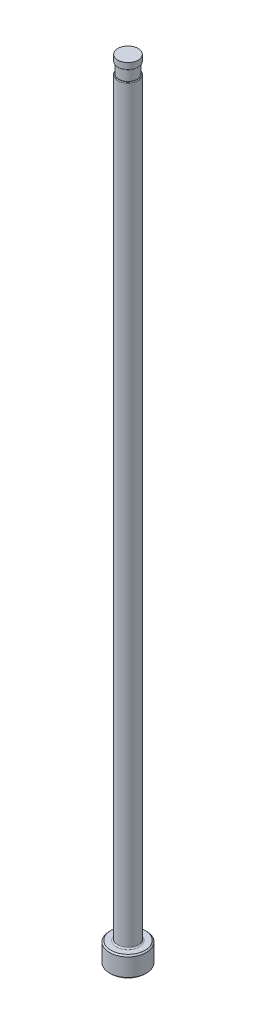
from build123d import *

# Parameters (mm, degrees)
CHAMFER1_SIZE     = 0.254
FILLET1_R         = 0.254
SKETCH2_W         = 0.2032
SKETCH2_H         = 2.032
D_SLOT_DEPTH      = 153.483544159
D_SLOT_DEPTH_BACK = 153.483544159
SKETCH5_W         = 0.01905
SKETCH5_H         = 1.27
FILLET2_R         = 0.127


with BuildPart() as part:
    # Sketch1 → Revolve1 (revolve)
    with BuildSketch(Plane.XY, mode=Mode.PRIVATE) as revolve1_sk:
        Polygon((0, 0), (-3.5687, 0), (-3.5687, 3.9624), (-1.98374, 3.9624), (-1.98374, 152.4), (0, 152.4), align=None)
    revolve(revolve1_sk.sketch.rotate(Axis((0, 259.958771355, 0), (0, -1, 0)), 270), axis=Axis((0, 259.958771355, 0), (0, -1, 0)))

    # Chamfer1
    chamfer1_edges = [part.edges().sort_by_distance(p)[0] for p in [
        (0, 3.9624, -3.5687),
        (0, 0, -3.5687),
    ]]
    chamfer(chamfer1_edges, length=CHAMFER1_SIZE)

    # Fillet1
    fillet1_edges = [part.edges().sort_by_distance(p)[0] for p in [
        (0, 3.9624, -1.98374),
    ]]
    fillet(fillet1_edges, radius=FILLET1_R)

    # Sketch2 → Vent Relief (revolve, cut)
    with BuildSketch(Plane.XY, mode=Mode.PRIVATE) as vent_relief_sk:
        with Locations((-1.88214, 150.114)):
            Rectangle(SKETCH2_W, SKETCH2_H)
    revolve(vent_relief_sk.sketch.rotate(Axis((0, 153.448281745, 0), (0, -1, 0)), 270), axis=Axis((0, 153.448281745, 0), (0, -1, 0)), mode=Mode.SUBTRACT)

    # Sketch3 → D-Slot (cut, two sides: drawn at the far end of the back side and taken through both)
    with BuildSketch(Plane.XY.offset(-D_SLOT_DEPTH_BACK)):
        with BuildLine():
            Line((-1.78054, 150.114), (-1.78054, 86.614))
            ThreePointArc((-1.78054, 86.614), (-1.831753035, 86.046038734), (-1.98374, 85.4964))
            Line((-1.98374, 85.4964), (-1.98374, 150.114))
            Line((-1.98374, 150.114), (-1.78054, 150.114))
        make_face()
    extrude(amount=D_SLOT_DEPTH + D_SLOT_DEPTH_BACK, mode=Mode.SUBTRACT)

    # Sketch5 → Vent Diameter (revolve, cut)
    with BuildSketch(Plane.XY, mode=Mode.PRIVATE) as vent_diameter_sk:
        with Locations((-1.974215, 151.765)):
            Rectangle(SKETCH5_W, SKETCH5_H)
    revolve(vent_diameter_sk.sketch.rotate(Axis((0, 152.687735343, 0), (0, -1, 0)), 90), axis=Axis((0, 152.687735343, 0), (0, -1, 0)), mode=Mode.SUBTRACT)

    # Fillet2
    fillet2_edges = [part.edges().sort_by_distance(p)[0] for p in [
        (1.683772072, 149.098, -1.04887368),
        (0, 151.13, 1.96469),
    ]]
    fillet(fillet2_edges, radius=FILLET2_R)


solid = part.part
